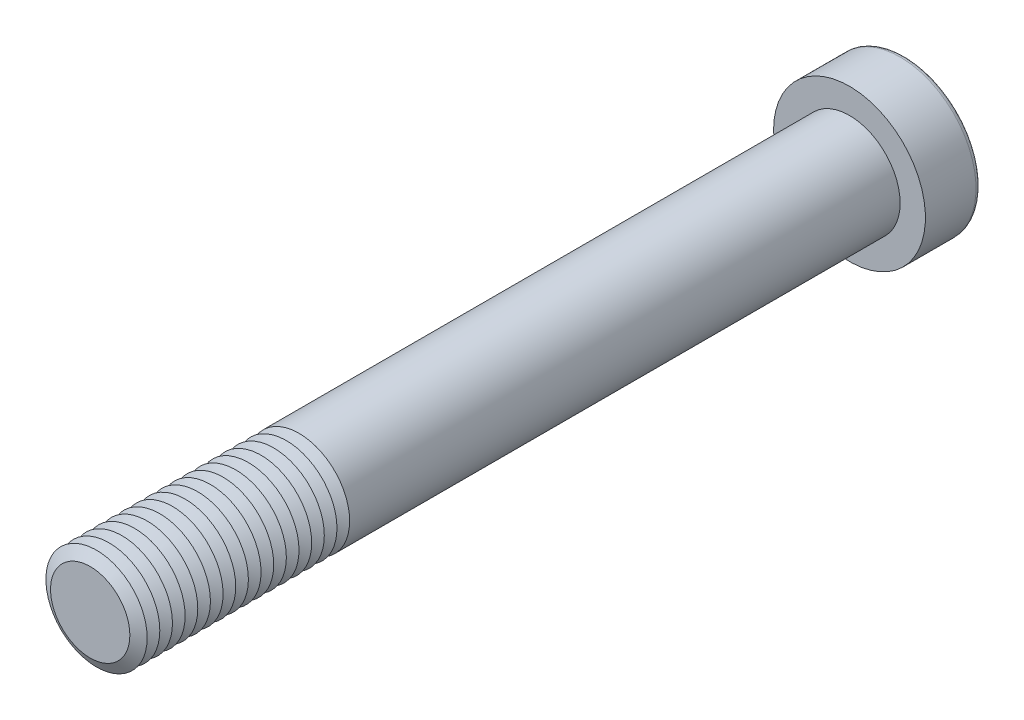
from build123d import *

# Parameters (mm, degrees)
SKETCH1_R           = 10
BOSS_EXTRUDE1_DEPTH = 150
SKETCH2_R           = 15
BOSS_EXTRUDE2_DEPTH = 11
CUT_EXTRUDE1_DEPTH  = 10.5
FILLET1_R           = 1
LPATTERN1_COUNT     = 17
LPATTERN1_PITCH     = 2.5


with BuildPart() as part:
    # Sketch1 → Boss-Extrude1 (new body)
    with BuildSketch(Plane.XY):
        Circle(SKETCH1_R)
    extrude(amount=BOSS_EXTRUDE1_DEPTH)

    # Sketch2 → Boss-Extrude2 (add)
    with BuildSketch(Plane(origin=(0, 0, 0), x_dir=(-1, 0, 0), z_dir=(0, 0, -1))):
        Circle(SKETCH2_R)
    extrude(amount=BOSS_EXTRUDE2_DEPTH)

    # Sketch3 → Cut-Extrude1 (cut)
    with BuildSketch(Plane(origin=(0, 0, -11), x_dir=(-1, 0, 0), z_dir=(0, 0, -1))):
        Polygon((-4.041451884, 7), (-8.082903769, 0), (-4.041451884, -7), (4.041451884, -7), (8.082903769, 0), (4.041451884, 7), align=None)
    extrude(amount=-CUT_EXTRUDE1_DEPTH, mode=Mode.SUBTRACT)

    # Fillet1
    fillet1_edges = [part.edges().sort_by_distance(p)[0] for p in [
        (15, 0, -11),
    ]]
    fillet(fillet1_edges, radius=FILLET1_R)

    # Cut-Extrude2 cone 1 section (on through the dimple's axis) → Cut-Extrude2 (revolve, cut)
    with BuildSketch(Plane(origin=(0, 0, -0.5), x_dir=(0, 1, 0), z_dir=(1, 0, 0))):
        Polygon((0, 0), (7, 0), (0, 4.041451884), align=None)
    revolve(axis=Axis((0, 0, -0.5), (0, 0, 1)), mode=Mode.SUBTRACT)

    # Cut-Extrude3 cone 1 section (on through the dimple's axis) → Cut-Extrude3 (revolve, cut)
    with BuildSketch(Plane(origin=(0, 0, -11), x_dir=(0, 1, 0), z_dir=(1, 0, 0))):
        Polygon((0, 0), (8.082903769, 0), (0, 2.165807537), align=None)
    revolve(axis=Axis((0, 0, -11), (0, 0, 1)), mode=Mode.SUBTRACT)

    # Sketch7 → Cut-Revolve1 (revolve, cut)
    with BuildSketch(Plane(origin=(0, 0, 0), x_dir=(0, 0, -1), z_dir=(1, 0, 0)), mode=Mode.PRIVATE) as cut_revolve1_sk:
        Polygon((-150, 7.834936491), (-148.75, 10), (-151.25, 10), align=None)
    cut_revolve1 = revolve(cut_revolve1_sk.sketch.rotate(Axis((0, 0, 150), (0, 0, -1)), 90), axis=Axis((0, 0, 150), (0, 0, -1)), mode=Mode.SUBTRACT)

    # LPattern1: Cut-Revolve1 ×17
    with Locations(*[(0, 0, -i * LPATTERN1_PITCH) for i in range(1, LPATTERN1_COUNT)]):
        add(cut_revolve1, mode=Mode.SUBTRACT)


solid = part.part
